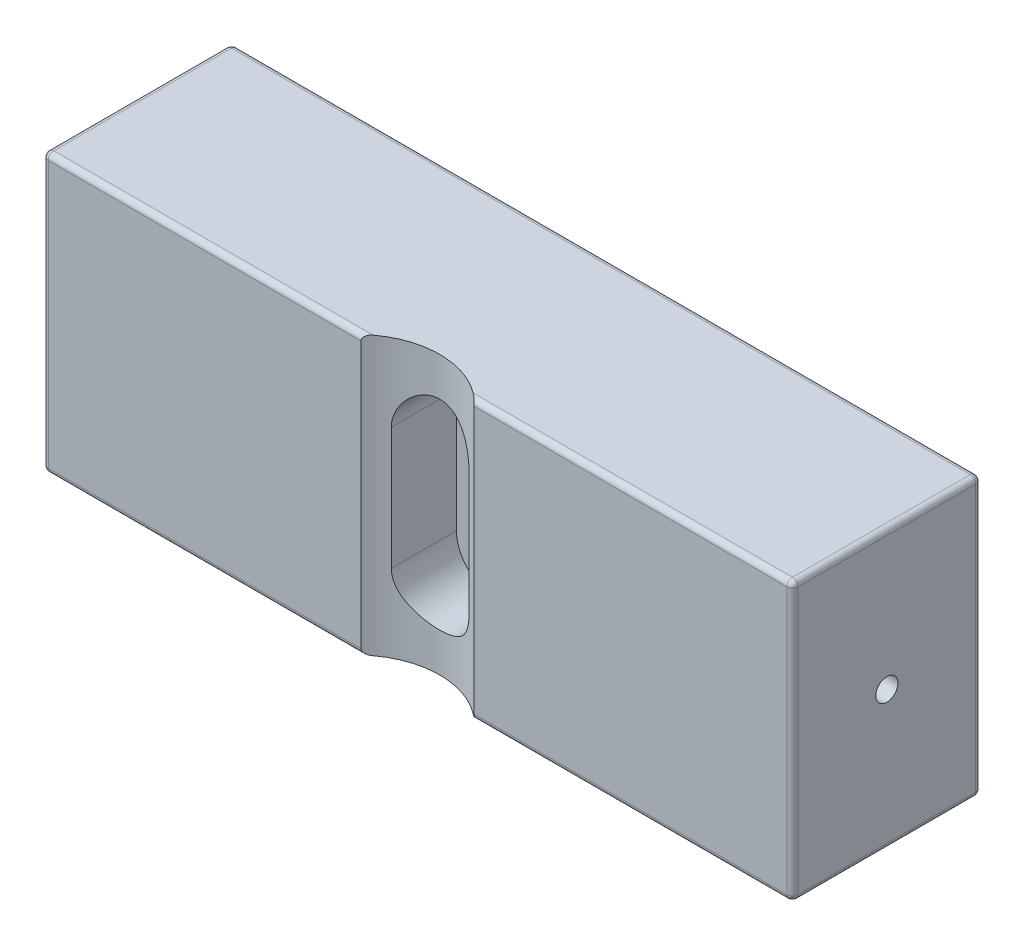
ISO-10303-21;
HEADER;
FILE_DESCRIPTION(('STEP AP214'),'2;1');
FILE_NAME('part.step','',(''),(''),'','','');
FILE_SCHEMA(('AUTOMOTIVE_DESIGN { 1 0 10303 214 1 1 1 1 }'));
ENDSEC;
DATA;
#1=APPLICATION_CONTEXT('core data for automotive mechanical design processes');
#2=APPLICATION_PROTOCOL_DEFINITION('international standard','automotive_design',2000,#1);
#3=PRODUCT_CONTEXT('',#1,'mechanical');
#4=PRODUCT('Part','Part','',(#3));
#5=PRODUCT_RELATED_PRODUCT_CATEGORY('part','',(#4));
#6=PRODUCT_DEFINITION_FORMATION('','',#4);
#7=PRODUCT_DEFINITION_CONTEXT('part definition',#1,'design');
#8=PRODUCT_DEFINITION('design','',#6,#7);
#9=PRODUCT_DEFINITION_SHAPE('','',#8);
#10=(LENGTH_UNIT() NAMED_UNIT(*) SI_UNIT(.MILLI.,.METRE.));
#11=(NAMED_UNIT(*) PLANE_ANGLE_UNIT() SI_UNIT($,.RADIAN.));
#12=(NAMED_UNIT(*) SI_UNIT($,.STERADIAN.) SOLID_ANGLE_UNIT());
#13=UNCERTAINTY_MEASURE_WITH_UNIT(LENGTH_MEASURE(1.E-05),#10,'distance_accuracy_value','');
#14=(GEOMETRIC_REPRESENTATION_CONTEXT(3) GLOBAL_UNCERTAINTY_ASSIGNED_CONTEXT((#13)) GLOBAL_UNIT_ASSIGNED_CONTEXT((#10,
#11,#12)) REPRESENTATION_CONTEXT('',''));
#15=CARTESIAN_POINT('',(0.,0.,0.));
#16=DIRECTION('',(0.,0.,1.));
#17=DIRECTION('',(1.,0.,0.));
#18=AXIS2_PLACEMENT_3D('',#15,#16,#17);
#19=CARTESIAN_POINT('',(0.,0.,34.));
#20=DIRECTION('',(0.,0.,-1.));
#21=DIRECTION('',(-1.,0.,0.));
#22=AXIS2_PLACEMENT_3D('',#19,#20,#21);
#23=PLANE('',#22);
#24=DIRECTION('',(0.,1.,0.));
#25=VECTOR('',#24,1.);
#26=CARTESIAN_POINT('',(-10.1980390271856,-67.4264068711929,34.));
#27=LINE('',#26,#25);
#28=CARTESIAN_POINT('',(-10.1980390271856,-24.,34.));
#29=VERTEX_POINT('',#28);
#30=CARTESIAN_POINT('',(-10.1980390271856,24.,34.));
#31=VERTEX_POINT('',#30);
#32=EDGE_CURVE('E221',#29,#31,#27,.T.);
#33=ORIENTED_EDGE('',*,*,#32,.T.);
#34=DIRECTION('',(-1.,0.,0.));
#35=VECTOR('',#34,1.);
#36=CARTESIAN_POINT('',(0.,24.,34.));
#37=LINE('',#36,#35);
#38=CARTESIAN_POINT('',(-66.5,24.,34.));
#39=VERTEX_POINT('',#38);
#40=EDGE_CURVE('E306',#31,#39,#37,.T.);
#41=ORIENTED_EDGE('',*,*,#40,.T.);
#42=DIRECTION('',(0.,-1.,0.));
#43=VECTOR('',#42,1.);
#44=CARTESIAN_POINT('',(-66.5,0.,34.));
#45=LINE('',#44,#43);
#46=CARTESIAN_POINT('',(-66.5,-24.,34.));
#47=VERTEX_POINT('',#46);
#48=EDGE_CURVE('E304',#39,#47,#45,.T.);
#49=ORIENTED_EDGE('',*,*,#48,.T.);
#50=DIRECTION('',(1.,0.,0.));
#51=VECTOR('',#50,1.);
#52=CARTESIAN_POINT('',(0.,-24.,34.));
#53=LINE('',#52,#51);
#54=EDGE_CURVE('E302',#47,#29,#53,.T.);
#55=ORIENTED_EDGE('',*,*,#54,.T.);
#56=EDGE_LOOP('',(#33,#41,#49,#55));
#57=FACE_BOUND('',#56,.T.);
#58=ADVANCED_FACE('F32',(#57),#23,.F.);
#59=CARTESIAN_POINT('',(67.5,-25.,34.));
#60=DIRECTION('',(-1.,0.,0.));
#61=DIRECTION('',(0.,0.,1.));
#62=AXIS2_PLACEMENT_3D('',#59,#60,#61);
#63=PLANE('',#62);
#64=DIRECTION('',(0.,1.,0.));
#65=VECTOR('',#64,1.);
#66=CARTESIAN_POINT('',(67.5,-25.,33.));
#67=LINE('',#66,#65);
#68=CARTESIAN_POINT('',(67.5,24.,33.));
#69=VERTEX_POINT('',#68);
#70=CARTESIAN_POINT('',(67.5,-24.,33.));
#71=VERTEX_POINT('',#70);
#72=EDGE_CURVE('E259',#69,#71,#67,.F.);
#73=ORIENTED_EDGE('',*,*,#72,.T.);
#74=DIRECTION('',(0.,0.,-1.));
#75=VECTOR('',#74,1.);
#76=CARTESIAN_POINT('',(67.5,-24.,34.));
#77=LINE('',#76,#75);
#78=CARTESIAN_POINT('',(67.5,-24.,1.));
#79=VERTEX_POINT('',#78);
#80=EDGE_CURVE('E264',#71,#79,#77,.T.);
#81=ORIENTED_EDGE('',*,*,#80,.T.);
#82=DIRECTION('',(0.,1.,0.));
#83=VECTOR('',#82,1.);
#84=CARTESIAN_POINT('',(67.5,25.,1.));
#85=LINE('',#84,#83);
#86=CARTESIAN_POINT('',(67.5,24.,1.));
#87=VERTEX_POINT('',#86);
#88=EDGE_CURVE('E261',#79,#87,#85,.T.);
#89=ORIENTED_EDGE('',*,*,#88,.T.);
#90=DIRECTION('',(0.,0.,-1.));
#91=VECTOR('',#90,1.);
#92=CARTESIAN_POINT('',(67.5,24.,34.));
#93=LINE('',#92,#91);
#94=EDGE_CURVE('E257',#87,#69,#93,.F.);
#95=ORIENTED_EDGE('',*,*,#94,.T.);
#96=EDGE_LOOP('',(#73,#81,#89,#95));
#97=FACE_BOUND('',#96,.T.);
#98=CARTESIAN_POINT('',(67.5,0.,17.));
#99=DIRECTION('',(-1.,0.,0.));
#100=DIRECTION('',(0.,0.,1.));
#101=AXIS2_PLACEMENT_3D('',#98,#99,#100);
#102=CIRCLE('',#101,2.00000000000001);
#103=CARTESIAN_POINT('',(67.5,0.,19.));
#104=VERTEX_POINT('',#103);
#105=EDGE_CURVE('E430',#104,#104,#102,.T.);
#106=ORIENTED_EDGE('',*,*,#105,.T.);
#107=EDGE_LOOP('',(#106));
#108=FACE_BOUND('',#107,.T.);
#109=ADVANCED_FACE('F458',(#97,#108),#63,.F.);
#110=CARTESIAN_POINT('',(-67.5,25.,34.));
#111=DIRECTION('',(0.,-1.,0.));
#112=DIRECTION('',(0.,0.,-1.));
#113=AXIS2_PLACEMENT_3D('',#110,#111,#112);
#114=PLANE('',#113);
#115=DIRECTION('',(0.,0.,-1.));
#116=VECTOR('',#115,1.);
#117=CARTESIAN_POINT('',(-66.5,25.,34.));
#118=LINE('',#117,#116);
#119=CARTESIAN_POINT('',(-66.5,25.,1.));
#120=VERTEX_POINT('',#119);
#121=CARTESIAN_POINT('',(-66.5,25.,33.));
#122=VERTEX_POINT('',#121);
#123=EDGE_CURVE('E282',#120,#122,#118,.F.);
#124=ORIENTED_EDGE('',*,*,#123,.T.);
#125=DIRECTION('',(-1.,0.,0.));
#126=VECTOR('',#125,1.);
#127=CARTESIAN_POINT('',(-67.5,25.,33.));
#128=LINE('',#127,#126);
#129=CARTESIAN_POINT('',(-9.00000000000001,25.,33.));
#130=VERTEX_POINT('',#129);
#131=EDGE_CURVE('E284',#122,#130,#128,.F.);
#132=ORIENTED_EDGE('',*,*,#131,.T.);
#133=CARTESIAN_POINT('',(0.,25.,45.));
#134=DIRECTION('',(0.,1.,0.));
#135=DIRECTION('',(0.,0.,1.));
#136=AXIS2_PLACEMENT_3D('',#133,#134,#135);
#137=CIRCLE('',#136,15.);
#138=CARTESIAN_POINT('',(9.00000000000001,25.,33.));
#139=VERTEX_POINT('',#138);
#140=EDGE_CURVE('E208',#139,#130,#137,.T.);
#141=ORIENTED_EDGE('',*,*,#140,.F.);
#142=DIRECTION('',(-1.,0.,0.));
#143=VECTOR('',#142,1.);
#144=CARTESIAN_POINT('',(-67.5,25.,33.));
#145=LINE('',#144,#143);
#146=CARTESIAN_POINT('',(66.5,25.,33.));
#147=VERTEX_POINT('',#146);
#148=EDGE_CURVE('E277',#139,#147,#145,.F.);
#149=ORIENTED_EDGE('',*,*,#148,.T.);
#150=DIRECTION('',(0.,0.,-1.));
#151=VECTOR('',#150,1.);
#152=CARTESIAN_POINT('',(66.5,25.,34.));
#153=LINE('',#152,#151);
#154=CARTESIAN_POINT('',(66.5,25.,1.));
#155=VERTEX_POINT('',#154);
#156=EDGE_CURVE('E275',#147,#155,#153,.T.);
#157=ORIENTED_EDGE('',*,*,#156,.T.);
#158=DIRECTION('',(-1.,0.,0.));
#159=VECTOR('',#158,1.);
#160=CARTESIAN_POINT('',(-67.5,25.,1.));
#161=LINE('',#160,#159);
#162=EDGE_CURVE('E279',#155,#120,#161,.T.);
#163=ORIENTED_EDGE('',*,*,#162,.T.);
#164=EDGE_LOOP('',(#124,#132,#141,#149,#157,#163));
#165=FACE_BOUND('',#164,.T.);
#166=ADVANCED_FACE('F449',(#165),#114,.F.);
#167=CARTESIAN_POINT('',(-67.5,-25.,34.));
#168=DIRECTION('',(1.,0.,0.));
#169=DIRECTION('',(0.,0.,-1.));
#170=AXIS2_PLACEMENT_3D('',#167,#168,#169);
#171=PLANE('',#170);
#172=DIRECTION('',(0.,0.,-1.));
#173=VECTOR('',#172,1.);
#174=CARTESIAN_POINT('',(-67.5,-24.,34.));
#175=LINE('',#174,#173);
#176=CARTESIAN_POINT('',(-67.5,-24.,1.));
#177=VERTEX_POINT('',#176);
#178=CARTESIAN_POINT('',(-67.5,-24.,33.));
#179=VERTEX_POINT('',#178);
#180=EDGE_CURVE('E42',#177,#179,#175,.F.);
#181=ORIENTED_EDGE('',*,*,#180,.T.);
#182=DIRECTION('',(0.,-1.,0.));
#183=VECTOR('',#182,1.);
#184=CARTESIAN_POINT('',(-67.5,-25.,33.));
#185=LINE('',#184,#183);
#186=CARTESIAN_POINT('',(-67.5,24.,33.));
#187=VERTEX_POINT('',#186);
#188=EDGE_CURVE('E11',#179,#187,#185,.F.);
#189=ORIENTED_EDGE('',*,*,#188,.T.);
#190=DIRECTION('',(0.,0.,-1.));
#191=VECTOR('',#190,1.);
#192=CARTESIAN_POINT('',(-67.5,24.,34.));
#193=LINE('',#192,#191);
#194=CARTESIAN_POINT('',(-67.5,24.,1.));
#195=VERTEX_POINT('',#194);
#196=EDGE_CURVE('E56',#187,#195,#193,.T.);
#197=ORIENTED_EDGE('',*,*,#196,.T.);
#198=DIRECTION('',(0.,-1.,0.));
#199=VECTOR('',#198,1.);
#200=CARTESIAN_POINT('',(-67.5,-25.,1.));
#201=LINE('',#200,#199);
#202=EDGE_CURVE('E360',#195,#177,#201,.T.);
#203=ORIENTED_EDGE('',*,*,#202,.T.);
#204=EDGE_LOOP('',(#181,#189,#197,#203));
#205=FACE_BOUND('',#204,.T.);
#206=CARTESIAN_POINT('',(-67.5,0.,17.));
#207=DIRECTION('',(-1.,0.,0.));
#208=DIRECTION('',(0.,0.,1.));
#209=AXIS2_PLACEMENT_3D('',#206,#207,#208);
#210=CIRCLE('',#209,2.00000000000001);
#211=CARTESIAN_POINT('',(-67.5,0.,19.));
#212=VERTEX_POINT('',#211);
#213=EDGE_CURVE('E200',#212,#212,#210,.T.);
#214=ORIENTED_EDGE('',*,*,#213,.F.);
#215=EDGE_LOOP('',(#214));
#216=FACE_BOUND('',#215,.T.);
#217=ADVANCED_FACE('F446',(#205,#216),#171,.F.);
#218=CARTESIAN_POINT('',(-67.5,-25.,34.));
#219=DIRECTION('',(0.,1.,0.));
#220=DIRECTION('',(0.,0.,1.));
#221=AXIS2_PLACEMENT_3D('',#218,#219,#220);
#222=PLANE('',#221);
#223=DIRECTION('',(0.,0.,-1.));
#224=VECTOR('',#223,1.);
#225=CARTESIAN_POINT('',(66.5,-25.,34.));
#226=LINE('',#225,#224);
#227=CARTESIAN_POINT('',(66.5,-25.,1.));
#228=VERTEX_POINT('',#227);
#229=CARTESIAN_POINT('',(66.5,-25.,33.));
#230=VERTEX_POINT('',#229);
#231=EDGE_CURVE('E292',#228,#230,#226,.F.);
#232=ORIENTED_EDGE('',*,*,#231,.T.);
#233=DIRECTION('',(1.,0.,0.));
#234=VECTOR('',#233,1.);
#235=CARTESIAN_POINT('',(-67.5,-25.,33.));
#236=LINE('',#235,#234);
#237=CARTESIAN_POINT('',(9.00000000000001,-25.,33.));
#238=VERTEX_POINT('',#237);
#239=EDGE_CURVE('E294',#230,#238,#236,.F.);
#240=ORIENTED_EDGE('',*,*,#239,.T.);
#241=CARTESIAN_POINT('',(0.,-25.,45.));
#242=DIRECTION('',(0.,1.,0.));
#243=DIRECTION('',(0.,0.,1.));
#244=AXIS2_PLACEMENT_3D('',#241,#242,#243);
#245=CIRCLE('',#244,15.);
#246=CARTESIAN_POINT('',(-9.00000000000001,-25.,33.));
#247=VERTEX_POINT('',#246);
#248=EDGE_CURVE('E215',#247,#238,#245,.F.);
#249=ORIENTED_EDGE('',*,*,#248,.F.);
#250=DIRECTION('',(1.,0.,0.));
#251=VECTOR('',#250,1.);
#252=CARTESIAN_POINT('',(-67.5,-25.,33.));
#253=LINE('',#252,#251);
#254=CARTESIAN_POINT('',(-66.5,-25.,33.));
#255=VERTEX_POINT('',#254);
#256=EDGE_CURVE('E288',#247,#255,#253,.F.);
#257=ORIENTED_EDGE('',*,*,#256,.T.);
#258=DIRECTION('',(0.,0.,-1.));
#259=VECTOR('',#258,1.);
#260=CARTESIAN_POINT('',(-66.5,-25.,34.));
#261=LINE('',#260,#259);
#262=CARTESIAN_POINT('',(-66.5,-25.,1.));
#263=VERTEX_POINT('',#262);
#264=EDGE_CURVE('E286',#255,#263,#261,.T.);
#265=ORIENTED_EDGE('',*,*,#264,.T.);
#266=DIRECTION('',(1.,0.,0.));
#267=VECTOR('',#266,1.);
#268=CARTESIAN_POINT('',(67.5,-25.,1.));
#269=LINE('',#268,#267);
#270=EDGE_CURVE('E290',#263,#228,#269,.T.);
#271=ORIENTED_EDGE('',*,*,#270,.T.);
#272=EDGE_LOOP('',(#232,#240,#249,#257,#265,#271));
#273=FACE_BOUND('',#272,.T.);
#274=ADVANCED_FACE('F448',(#273),#222,.F.);
#275=DIRECTION('',(0.,1.,0.));
#276=VECTOR('',#275,1.);
#277=CARTESIAN_POINT('',(66.5,0.,34.));
#278=LINE('',#277,#276);
#279=CARTESIAN_POINT('',(66.5,-24.,34.));
#280=VERTEX_POINT('',#279);
#281=CARTESIAN_POINT('',(66.5,24.,34.));
#282=VERTEX_POINT('',#281);
#283=EDGE_CURVE('E298',#280,#282,#278,.T.);
#284=ORIENTED_EDGE('',*,*,#283,.T.);
#285=DIRECTION('',(-1.,0.,0.));
#286=VECTOR('',#285,1.);
#287=CARTESIAN_POINT('',(0.,24.,34.));
#288=LINE('',#287,#286);
#289=CARTESIAN_POINT('',(10.1980390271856,24.,34.));
#290=VERTEX_POINT('',#289);
#291=EDGE_CURVE('E300',#282,#290,#288,.T.);
#292=ORIENTED_EDGE('',*,*,#291,.T.);
#293=DIRECTION('',(0.,1.,0.));
#294=VECTOR('',#293,1.);
#295=CARTESIAN_POINT('',(10.1980390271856,-67.4264068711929,34.));
#296=LINE('',#295,#294);
#297=CARTESIAN_POINT('',(10.1980390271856,-24.,34.));
#298=VERTEX_POINT('',#297);
#299=EDGE_CURVE('E218',#290,#298,#296,.F.);
#300=ORIENTED_EDGE('',*,*,#299,.T.);
#301=DIRECTION('',(1.,0.,0.));
#302=VECTOR('',#301,1.);
#303=CARTESIAN_POINT('',(0.,-24.,34.));
#304=LINE('',#303,#302);
#305=EDGE_CURVE('E296',#298,#280,#304,.T.);
#306=ORIENTED_EDGE('',*,*,#305,.T.);
#307=EDGE_LOOP('',(#284,#292,#300,#306));
#308=FACE_BOUND('',#307,.T.);
#309=ADVANCED_FACE('F455',(#308),#23,.F.);
#310=CARTESIAN_POINT('',(0.,0.,0.));
#311=DIRECTION('',(0.,0.,-1.));
#312=DIRECTION('',(-1.,0.,0.));
#313=AXIS2_PLACEMENT_3D('',#310,#311,#312);
#314=PLANE('',#313);
#315=DIRECTION('',(-1.,0.,0.));
#316=VECTOR('',#315,1.);
#317=CARTESIAN_POINT('',(67.5,24.,0.));
#318=LINE('',#317,#316);
#319=CARTESIAN_POINT('',(-66.5,24.,0.));
#320=VERTEX_POINT('',#319);
#321=CARTESIAN_POINT('',(66.5,24.,0.));
#322=VERTEX_POINT('',#321);
#323=EDGE_CURVE('E270',#320,#322,#318,.F.);
#324=ORIENTED_EDGE('',*,*,#323,.T.);
#325=DIRECTION('',(0.,1.,0.));
#326=VECTOR('',#325,1.);
#327=CARTESIAN_POINT('',(66.5,-25.,0.));
#328=LINE('',#327,#326);
#329=CARTESIAN_POINT('',(66.5,-24.,0.));
#330=VERTEX_POINT('',#329);
#331=EDGE_CURVE('E272',#322,#330,#328,.F.);
#332=ORIENTED_EDGE('',*,*,#331,.T.);
#333=DIRECTION('',(1.,0.,0.));
#334=VECTOR('',#333,1.);
#335=CARTESIAN_POINT('',(-67.5,-24.,0.));
#336=LINE('',#335,#334);
#337=CARTESIAN_POINT('',(-66.5,-24.,0.));
#338=VERTEX_POINT('',#337);
#339=EDGE_CURVE('E268',#330,#338,#336,.F.);
#340=ORIENTED_EDGE('',*,*,#339,.T.);
#341=DIRECTION('',(0.,-1.,0.));
#342=VECTOR('',#341,1.);
#343=CARTESIAN_POINT('',(-66.5,25.,0.));
#344=LINE('',#343,#342);
#345=EDGE_CURVE('E266',#338,#320,#344,.F.);
#346=ORIENTED_EDGE('',*,*,#345,.T.);
#347=EDGE_LOOP('',(#324,#332,#340,#346));
#348=FACE_BOUND('',#347,.T.);
#349=ADVANCED_FACE('F470',(#348),#314,.T.);
#350=CARTESIAN_POINT('',(0.,-67.4264068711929,45.));
#351=DIRECTION('',(0.,1.,0.));
#352=DIRECTION('',(0.,0.,1.));
#353=AXIS2_PLACEMENT_3D('',#350,#351,#352);
#354=CYLINDRICAL_SURFACE('',#353,15.);
#355=DIRECTION('',(0.,1.,0.));
#356=VECTOR('',#355,1.);
#357=CARTESIAN_POINT('',(7.00000000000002,-67.4264068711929,31.7335008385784));
#358=LINE('',#357,#356);
#359=CARTESIAN_POINT('',(7.,11.,31.7335008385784));
#360=VERTEX_POINT('',#359);
#361=CARTESIAN_POINT('',(7.00000000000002,-11.,31.7335008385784));
#362=VERTEX_POINT('',#361);
#363=EDGE_CURVE('E224',#360,#362,#358,.F.);
#364=ORIENTED_EDGE('',*,*,#363,.T.);
#365=CARTESIAN_POINT('',(7.,-11.,31.7335008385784));
#366=CARTESIAN_POINT('',(7.00003274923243,-11.1851244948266,31.7335501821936));
#367=CARTESIAN_POINT('',(6.99265774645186,-11.3702267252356,31.7296275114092));
#368=CARTESIAN_POINT('',(6.96334178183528,-11.7388617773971,31.7142041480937));
#369=CARTESIAN_POINT('',(6.94140847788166,-11.9223953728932,31.7027074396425));
#370=CARTESIAN_POINT('',(6.88337286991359,-12.2856402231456,31.6725780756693));
#371=CARTESIAN_POINT('',(6.84734316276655,-12.4653661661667,31.6539819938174));
#372=CARTESIAN_POINT('',(6.76154095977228,-12.8207064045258,31.6103064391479));
#373=CARTESIAN_POINT('',(6.71176716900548,-12.9963203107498,31.5852263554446));
#374=CARTESIAN_POINT('',(6.59910143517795,-13.3419716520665,31.5294472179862));
#375=CARTESIAN_POINT('',(6.53623584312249,-13.5120195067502,31.4987594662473));
#376=CARTESIAN_POINT('',(6.39789853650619,-13.8459808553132,31.432657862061));
#377=CARTESIAN_POINT('',(6.32242204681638,-14.0098919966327,31.3972422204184));
#378=CARTESIAN_POINT('',(6.07778751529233,-14.4914233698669,31.2853119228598));
#379=CARTESIAN_POINT('',(5.89046347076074,-14.7987228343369,31.2031341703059));
#380=CARTESIAN_POINT('',(5.45752973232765,-15.4002848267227,31.0259583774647));
#381=CARTESIAN_POINT('',(5.20873505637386,-15.6920886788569,30.9304646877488));
#382=CARTESIAN_POINT('',(4.66630119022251,-16.2318046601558,30.7413927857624));
#383=CARTESIAN_POINT('',(4.3726510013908,-16.4797059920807,30.6478150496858));
#384=CARTESIAN_POINT('',(3.89437528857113,-16.8202410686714,30.5133322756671));
#385=CARTESIAN_POINT('',(3.72352355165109,-16.9310201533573,30.4683737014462));
#386=CARTESIAN_POINT('',(3.37202239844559,-17.1376677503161,30.3828145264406));
#387=CARTESIAN_POINT('',(3.19137712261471,-17.2335424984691,30.3422121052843));
#388=CARTESIAN_POINT('',(2.82147212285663,-17.4094652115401,30.2665367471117));
#389=CARTESIAN_POINT('',(2.63221405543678,-17.4895162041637,30.231462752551));
#390=CARTESIAN_POINT('',(2.24641271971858,-17.6329454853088,30.1678784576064));
#391=CARTESIAN_POINT('',(2.04987011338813,-17.6963252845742,30.1393675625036));
#392=CARTESIAN_POINT('',(1.6637103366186,-17.8021742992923,30.0913616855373));
#393=CARTESIAN_POINT('',(1.47444294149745,-17.8457136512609,30.0714100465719));
#394=CARTESIAN_POINT('',(1.09234411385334,-17.9169751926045,30.0385982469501));
#395=CARTESIAN_POINT('',(0.899512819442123,-17.9446979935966,30.0257378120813));
#396=CARTESIAN_POINT('',(0.511939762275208,-17.9839703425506,30.0074838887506));
#397=CARTESIAN_POINT('',(0.317198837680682,-17.9955266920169,30.0020872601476));
#398=CARTESIAN_POINT('',(-0.0726257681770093,-18.0023368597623,29.9989096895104));
#399=CARTESIAN_POINT('',(-0.267709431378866,-17.9975915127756,30.0011283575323));
#400=CARTESIAN_POINT('',(-0.641717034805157,-17.9728473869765,30.0126554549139));
#401=CARTESIAN_POINT('',(-0.820738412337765,-17.9540398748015,30.0214101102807));
#402=CARTESIAN_POINT('',(-1.17645951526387,-17.9027707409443,30.0451437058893));
#403=CARTESIAN_POINT('',(-1.35315842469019,-17.8703044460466,30.0601247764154));
#404=CARTESIAN_POINT('',(-1.70290661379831,-17.7920696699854,30.0959400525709));
#405=CARTESIAN_POINT('',(-1.87595719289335,-17.7463060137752,30.1167721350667));
#406=CARTESIAN_POINT('',(-2.21744279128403,-17.6419006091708,30.1638053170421));
#407=CARTESIAN_POINT('',(-2.38587601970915,-17.5832539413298,30.1900084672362));
#408=CARTESIAN_POINT('',(-2.7194870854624,-17.4526685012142,30.2475952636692));
#409=CARTESIAN_POINT('',(-2.88458239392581,-17.380549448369,30.2790484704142));
#410=CARTESIAN_POINT('',(-3.20807160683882,-17.22419439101,30.3461397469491));
#411=CARTESIAN_POINT('',(-3.36646305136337,-17.1399539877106,30.3817793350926));
#412=CARTESIAN_POINT('',(-3.83032730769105,-16.8699591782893,30.4938113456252));
#413=CARTESIAN_POINT('',(-4.12468757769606,-16.6668532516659,30.5753525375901));
#414=CARTESIAN_POINT('',(-4.70140559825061,-16.2005767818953,30.7523486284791));
#415=CARTESIAN_POINT('',(-4.9806178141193,-15.933768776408,30.8483970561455));
#416=CARTESIAN_POINT('',(-5.49207336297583,-15.357234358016,31.0389236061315));
#417=CARTESIAN_POINT('',(-5.72428311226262,-15.0474775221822,31.1334005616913));
#418=CARTESIAN_POINT('',(-6.03795030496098,-14.5474792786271,31.2683922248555));
#419=CARTESIAN_POINT('',(-6.13867739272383,-14.3702200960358,31.3132506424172));
#420=CARTESIAN_POINT('',(-6.32466275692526,-14.0067033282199,31.3981958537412));
#421=CARTESIAN_POINT('',(-6.40992781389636,-13.8204497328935,31.4382847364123));
#422=CARTESIAN_POINT('',(-6.56402317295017,-13.4404053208,31.5121940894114));
#423=CARTESIAN_POINT('',(-6.63287915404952,-13.2466268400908,31.5460243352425));
#424=CARTESIAN_POINT('',(-6.7534883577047,-12.85278346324,31.6061607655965));
#425=CARTESIAN_POINT('',(-6.80524910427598,-12.6527213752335,31.6324702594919));
#426=CARTESIAN_POINT('',(-6.89835333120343,-12.2130277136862,31.6802412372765));
#427=CARTESIAN_POINT('',(-6.93638471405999,-11.972497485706,31.7000959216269));
#428=CARTESIAN_POINT('',(-6.97450458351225,-11.6092331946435,31.720072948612));
#429=CARTESIAN_POINT('',(-6.98405670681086,-11.4876733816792,31.7250978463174));
#430=CARTESIAN_POINT('',(-6.99680619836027,-11.2440864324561,31.7318150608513));
#431=CARTESIAN_POINT('',(-7.0000013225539,-11.1220591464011,31.7335062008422));
#432=CARTESIAN_POINT('',(-7.,-11.,31.7335008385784));
#433=B_SPLINE_CURVE_WITH_KNOTS('',3,(#365,#366,#367,#368,#369,#370,#371,#372,#373,#374,#375,
#376,#377,#378,#379,#380,#381,#382,#383,#384,#385,#386,#387,#388,#389,#390,#391,#392,#393,#394,
#395,#396,#397,#398,#399,#400,#401,#402,#403,#404,#405,#406,#407,#408,#409,#410,#411,#412,#413,
#414,#415,#416,#417,#418,#419,#420,#421,#422,#423,#424,#425,#426,#427,#428,#429,#430,#431,#432),
.UNSPECIFIED.,.F.,.F.,(4,2,2,2,2,2,2,2,2,2,2,2,2,2,2,2,2,2,2,2,2,2,2,2,2,2,2,2,2,2,2,2,2,4),(0.,
0.555149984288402,1.11000818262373,1.66204568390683,2.21413521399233,2.76512406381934,
3.31632202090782,4.41909352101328,5.59984914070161,6.78089474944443,7.40580354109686,
8.03045016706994,8.65497715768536,9.27944753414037,9.86436700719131,10.4492638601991,
11.0339145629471,11.6185353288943,12.158556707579,12.6987629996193,13.2387735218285,
13.7789906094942,14.3270350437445,14.8752788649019,15.971127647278,17.1600982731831,
18.3499154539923,18.9755024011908,19.6008143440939,20.2251411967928,20.8491929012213,
21.5803389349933,21.9462710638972,22.3123323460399),.UNSPECIFIED.);
#434=CARTESIAN_POINT('',(-7.,-11.,31.7335008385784));
#435=VERTEX_POINT('',#434);
#436=EDGE_CURVE('E180',#362,#435,#433,.T.);
#437=ORIENTED_EDGE('',*,*,#436,.T.);
#438=DIRECTION('',(0.,1.,0.));
#439=VECTOR('',#438,1.);
#440=CARTESIAN_POINT('',(-6.99999999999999,-67.4264068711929,31.7335008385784));
#441=LINE('',#440,#439);
#442=CARTESIAN_POINT('',(-7.00000000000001,11.,31.7335008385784));
#443=VERTEX_POINT('',#442);
#444=EDGE_CURVE('E235',#435,#443,#441,.T.);
#445=ORIENTED_EDGE('',*,*,#444,.T.);
#446=CARTESIAN_POINT('',(-7.00000000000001,11.,31.7335008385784));
#447=CARTESIAN_POINT('',(-7.00003274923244,11.1851244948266,31.7335501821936));
#448=CARTESIAN_POINT('',(-6.99265774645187,11.3702267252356,31.7296275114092));
#449=CARTESIAN_POINT('',(-6.96334178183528,11.7388617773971,31.7142041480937));
#450=CARTESIAN_POINT('',(-6.94140847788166,11.9223953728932,31.7027074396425));
#451=CARTESIAN_POINT('',(-6.8833728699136,12.2856402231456,31.6725780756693));
#452=CARTESIAN_POINT('',(-6.84734316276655,12.4653661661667,31.6539819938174));
#453=CARTESIAN_POINT('',(-6.76154095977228,12.8207064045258,31.6103064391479));
#454=CARTESIAN_POINT('',(-6.71176716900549,12.9963203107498,31.5852263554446));
#455=CARTESIAN_POINT('',(-6.59910143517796,13.3419716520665,31.5294472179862));
#456=CARTESIAN_POINT('',(-6.5362358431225,13.5120195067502,31.4987594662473));
#457=CARTESIAN_POINT('',(-6.39789853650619,13.8459808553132,31.432657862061));
#458=CARTESIAN_POINT('',(-6.32242204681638,14.0098919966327,31.3972422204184));
#459=CARTESIAN_POINT('',(-6.07778751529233,14.4914233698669,31.2853119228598));
#460=CARTESIAN_POINT('',(-5.89046347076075,14.7987228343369,31.2031341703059));
#461=CARTESIAN_POINT('',(-5.45752973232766,15.4002848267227,31.0259583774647));
#462=CARTESIAN_POINT('',(-5.20873505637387,15.6920886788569,30.9304646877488));
#463=CARTESIAN_POINT('',(-4.66630119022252,16.2318046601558,30.7413927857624));
#464=CARTESIAN_POINT('',(-4.37265100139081,16.4797059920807,30.6478150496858));
#465=CARTESIAN_POINT('',(-3.89437528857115,16.8202410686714,30.5133322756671));
#466=CARTESIAN_POINT('',(-3.7235235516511,16.9310201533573,30.4683737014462));
#467=CARTESIAN_POINT('',(-3.37202239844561,17.1376677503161,30.3828145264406));
#468=CARTESIAN_POINT('',(-3.19137712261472,17.2335424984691,30.3422121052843));
#469=CARTESIAN_POINT('',(-2.82147212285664,17.4094652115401,30.2665367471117));
#470=CARTESIAN_POINT('',(-2.6322140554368,17.4895162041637,30.231462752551));
#471=CARTESIAN_POINT('',(-2.2464127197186,17.6329454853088,30.1678784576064));
#472=CARTESIAN_POINT('',(-2.04987011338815,17.6963252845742,30.1393675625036));
#473=CARTESIAN_POINT('',(-1.66371033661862,17.8021742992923,30.0913616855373));
#474=CARTESIAN_POINT('',(-1.47444294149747,17.8457136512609,30.0714100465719));
#475=CARTESIAN_POINT('',(-1.09234411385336,17.9169751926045,30.0385982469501));
#476=CARTESIAN_POINT('',(-0.89951281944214,17.9446979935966,30.0257378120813));
#477=CARTESIAN_POINT('',(-0.511939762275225,17.9839703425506,30.0074838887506));
#478=CARTESIAN_POINT('',(-0.317198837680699,17.9955266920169,30.0020872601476));
#479=CARTESIAN_POINT('',(0.0726257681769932,18.0023368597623,29.9989096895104));
#480=CARTESIAN_POINT('',(0.267709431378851,17.9975915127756,30.0011283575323));
#481=CARTESIAN_POINT('',(0.641717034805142,17.9728473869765,30.0126554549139));
#482=CARTESIAN_POINT('',(0.82073841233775,17.9540398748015,30.0214101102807));
#483=CARTESIAN_POINT('',(1.17645951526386,17.9027707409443,30.0451437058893));
#484=CARTESIAN_POINT('',(1.35315842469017,17.8703044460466,30.0601247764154));
#485=CARTESIAN_POINT('',(1.7029066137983,17.7920696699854,30.0959400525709));
#486=CARTESIAN_POINT('',(1.87595719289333,17.7463060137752,30.1167721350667));
#487=CARTESIAN_POINT('',(2.21744279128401,17.6419006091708,30.1638053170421));
#488=CARTESIAN_POINT('',(2.38587601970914,17.5832539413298,30.1900084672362));
#489=CARTESIAN_POINT('',(2.71948708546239,17.4526685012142,30.2475952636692));
#490=CARTESIAN_POINT('',(2.8845823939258,17.380549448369,30.2790484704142));
#491=CARTESIAN_POINT('',(3.20807160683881,17.22419439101,30.3461397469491));
#492=CARTESIAN_POINT('',(3.36646305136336,17.1399539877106,30.3817793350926));
#493=CARTESIAN_POINT('',(3.83032730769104,16.8699591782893,30.4938113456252));
#494=CARTESIAN_POINT('',(4.12468757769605,16.6668532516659,30.5753525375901));
#495=CARTESIAN_POINT('',(4.7014055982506,16.2005767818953,30.7523486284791));
#496=CARTESIAN_POINT('',(4.98061781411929,15.933768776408,30.8483970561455));
#497=CARTESIAN_POINT('',(5.49207336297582,15.357234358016,31.0389236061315));
#498=CARTESIAN_POINT('',(5.7242831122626,15.0474775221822,31.1334005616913));
#499=CARTESIAN_POINT('',(6.03795030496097,14.5474792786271,31.2683922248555));
#500=CARTESIAN_POINT('',(6.13867739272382,14.3702200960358,31.3132506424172));
#501=CARTESIAN_POINT('',(6.32466275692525,14.0067033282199,31.3981958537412));
#502=CARTESIAN_POINT('',(6.40992781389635,13.8204497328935,31.4382847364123));
#503=CARTESIAN_POINT('',(6.56402317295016,13.4404053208,31.5121940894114));
#504=CARTESIAN_POINT('',(6.63287915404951,13.2466268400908,31.5460243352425));
#505=CARTESIAN_POINT('',(6.7534883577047,12.85278346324,31.6061607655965));
#506=CARTESIAN_POINT('',(6.80524910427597,12.6527213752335,31.6324702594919));
#507=CARTESIAN_POINT('',(6.89835333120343,12.2130277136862,31.6802412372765));
#508=CARTESIAN_POINT('',(6.93638471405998,11.972497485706,31.7000959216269));
#509=CARTESIAN_POINT('',(6.97450458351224,11.6092331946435,31.720072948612));
#510=CARTESIAN_POINT('',(6.98405670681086,11.4876733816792,31.7250978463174));
#511=CARTESIAN_POINT('',(6.99680619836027,11.2440864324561,31.7318150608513));
#512=CARTESIAN_POINT('',(7.00000132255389,11.1220591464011,31.7335062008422));
#513=CARTESIAN_POINT('',(7.,11.,31.7335008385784));
#514=B_SPLINE_CURVE_WITH_KNOTS('',3,(#446,#447,#448,#449,#450,#451,#452,#453,#454,#455,#456,
#457,#458,#459,#460,#461,#462,#463,#464,#465,#466,#467,#468,#469,#470,#471,#472,#473,#474,#475,
#476,#477,#478,#479,#480,#481,#482,#483,#484,#485,#486,#487,#488,#489,#490,#491,#492,#493,#494,
#495,#496,#497,#498,#499,#500,#501,#502,#503,#504,#505,#506,#507,#508,#509,#510,#511,#512,#513),
.UNSPECIFIED.,.F.,.F.,(4,2,2,2,2,2,2,2,2,2,2,2,2,2,2,2,2,2,2,2,2,2,2,2,2,2,2,2,2,2,2,2,2,4),(0.,
0.555149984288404,1.11000818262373,1.66204568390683,2.21413521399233,2.76512406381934,
3.31632202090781,4.41909352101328,5.59984914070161,6.78089474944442,7.40580354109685,
8.03045016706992,8.65497715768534,9.27944753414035,9.8643670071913,10.4492638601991,
11.0339145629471,11.6185353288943,12.158556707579,12.6987629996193,13.2387735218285,
13.7789906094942,14.3270350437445,14.8752788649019,15.971127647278,17.1600982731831,
18.3499154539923,18.9755024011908,19.6008143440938,20.2251411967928,20.8491929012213,
21.5803389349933,21.9462710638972,22.3123323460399),.UNSPECIFIED.);
#515=EDGE_CURVE('E226',#443,#360,#514,.T.);
#516=ORIENTED_EDGE('',*,*,#515,.T.);
#517=EDGE_LOOP('',(#364,#437,#445,#516));
#518=FACE_BOUND('',#517,.T.);
#519=ORIENTED_EDGE('',*,*,#140,.T.);
#520=CARTESIAN_POINT('',(-9.00000000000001,25.,33.));
#521=CARTESIAN_POINT('',(-9.05562458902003,24.9999753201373,33.0417120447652));
#522=CARTESIAN_POINT('',(-9.1109859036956,24.9973868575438,33.0838435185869));
#523=CARTESIAN_POINT('',(-9.22098644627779,24.9865967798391,33.1687610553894));
#524=CARTESIAN_POINT('',(-9.27562203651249,24.9783734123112,33.2115490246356));
#525=CARTESIAN_POINT('',(-9.38429669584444,24.9556621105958,33.2978691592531));
#526=CARTESIAN_POINT('',(-9.43831654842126,24.9410876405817,33.341403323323));
#527=CARTESIAN_POINT('',(-9.54426805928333,24.905002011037,33.4279814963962));
#528=CARTESIAN_POINT('',(-9.59620332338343,24.8835034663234,33.4710262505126));
#529=CARTESIAN_POINT('',(-9.69611257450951,24.8332984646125,33.5549329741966));
#530=CARTESIAN_POINT('',(-9.74414950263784,24.8047655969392,33.5958222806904));
#531=CARTESIAN_POINT('',(-9.83625125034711,24.7394445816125,33.6751674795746));
#532=CARTESIAN_POINT('',(-9.88032940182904,24.7026857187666,33.7136313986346));
#533=CARTESIAN_POINT('',(-9.95536580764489,24.6276313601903,33.7798074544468));
#534=CARTESIAN_POINT('',(-9.9872453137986,24.5908655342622,33.8081951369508));
#535=CARTESIAN_POINT('',(-10.0460413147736,24.5109423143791,33.8609422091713));
#536=CARTESIAN_POINT('',(-10.0729627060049,24.4677913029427,33.885305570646));
#537=CARTESIAN_POINT('',(-10.1147059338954,24.3860776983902,33.9232977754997));
#538=CARTESIAN_POINT('',(-10.1308861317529,24.3487614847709,33.9381061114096));
#539=CARTESIAN_POINT('',(-10.1584602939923,24.2710672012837,33.9634228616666));
#540=CARTESIAN_POINT('',(-10.1698649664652,24.2306962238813,33.9739408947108));
#541=CARTESIAN_POINT('',(-10.1849111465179,24.1585795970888,33.9878401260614));
#542=CARTESIAN_POINT('',(-10.1897984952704,24.1273095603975,33.9923644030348));
#543=CARTESIAN_POINT('',(-10.1963789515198,24.0640397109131,33.9984609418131));
#544=CARTESIAN_POINT('',(-10.1980603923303,24.0320376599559,34.0000224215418));
#545=CARTESIAN_POINT('',(-10.1980390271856,24.,34.));
#546=B_SPLINE_CURVE_WITH_KNOTS('',3,(#520,#521,#522,#523,#524,#525,#526,#527,#528,#529,#530,
#531,#532,#533,#534,#535,#536,#537,#538,#539,#540,#541,#542,#543,#544,#545),.UNSPECIFIED.,.F.,
.F.,(4,2,2,2,2,2,2,2,2,2,2,2,4),(0.,0.208594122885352,0.417998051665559,0.6303490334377,
0.842315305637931,1.04949865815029,1.25595584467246,1.42439173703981,1.59266038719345,
1.72201818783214,1.85108435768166,1.94670719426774,2.04267735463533),.UNSPECIFIED.);
#547=EDGE_CURVE('E354',#130,#31,#546,.T.);
#548=ORIENTED_EDGE('',*,*,#547,.T.);
#549=ORIENTED_EDGE('',*,*,#32,.F.);
#550=CARTESIAN_POINT('',(-10.1980390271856,-24.,34.));
#551=CARTESIAN_POINT('',(-10.1980418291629,-24.0217460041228,34.0000030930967));
#552=CARTESIAN_POINT('',(-10.1972732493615,-24.043478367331,33.999290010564));
#553=CARTESIAN_POINT('',(-10.1942272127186,-24.0867287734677,33.9964670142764));
#554=CARTESIAN_POINT('',(-10.1919509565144,-24.1082469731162,33.994358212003));
#555=CARTESIAN_POINT('',(-10.1829674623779,-24.1718422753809,33.9860432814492));
#556=CARTESIAN_POINT('',(-10.1741040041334,-24.2133840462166,33.9778470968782));
#557=CARTESIAN_POINT('',(-10.1512833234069,-24.2936052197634,33.956826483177));
#558=CARTESIAN_POINT('',(-10.1373405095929,-24.3322923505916,33.9440151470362));
#559=CARTESIAN_POINT('',(-10.1051528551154,-24.4063516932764,33.9145878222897));
#560=CARTESIAN_POINT('',(-10.0868981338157,-24.4417160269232,33.8979630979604));
#561=CARTESIAN_POINT('',(-10.0385413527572,-24.5227643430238,33.8541874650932));
#562=CARTESIAN_POINT('',(-10.006676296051,-24.5665849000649,33.825541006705));
#563=CARTESIAN_POINT('',(-9.93788326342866,-24.6468223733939,33.7643152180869));
#564=CARTESIAN_POINT('',(-9.90094709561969,-24.6832270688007,33.7317295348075));
#565=CARTESIAN_POINT('',(-9.80527307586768,-24.7645835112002,33.6482474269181));
#566=CARTESIAN_POINT('',(-9.74442260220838,-24.8055604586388,33.5959192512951));
#567=CARTESIAN_POINT('',(-9.61762561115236,-24.8747464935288,33.4887782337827));
#568=CARTESIAN_POINT('',(-9.55165967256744,-24.9029038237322,33.4339562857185));
#569=CARTESIAN_POINT('',(-9.44508744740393,-24.9385021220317,33.3469798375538));
#570=CARTESIAN_POINT('',(-9.4055131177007,-24.9496724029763,33.3150118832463));
#571=CARTESIAN_POINT('',(-9.32551974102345,-24.9685425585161,33.2510723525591));
#572=CARTESIAN_POINT('',(-9.28510039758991,-24.9762411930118,33.2191007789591));
#573=CARTESIAN_POINT('',(-9.20412837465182,-24.9883195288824,33.1557342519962));
#574=CARTESIAN_POINT('',(-9.16358316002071,-24.9927380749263,33.1243369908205));
#575=CARTESIAN_POINT('',(-9.08207584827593,-24.9985732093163,33.0618870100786));
#576=CARTESIAN_POINT('',(-9.04111420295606,-24.9999927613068,33.0308339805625));
#577=CARTESIAN_POINT('',(-9.00000000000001,-25.,33.));
#578=B_SPLINE_CURVE_WITH_KNOTS('',3,(#550,#551,#552,#553,#554,#555,#556,#557,#558,#559,#560,
#561,#562,#563,#564,#565,#566,#567,#568,#569,#570,#571,#572,#573,#574,#575,#576,#577),
.UNSPECIFIED.,.F.,.F.,(4,2,2,2,2,2,2,2,2,2,2,2,2,4),(0.,0.06518695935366,0.130322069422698,
0.259340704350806,0.3879961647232,0.516949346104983,0.699791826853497,0.882933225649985,
1.15179425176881,1.42173134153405,1.57787751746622,1.73407942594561,1.88840062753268,
2.04256925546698),.UNSPECIFIED.);
#579=EDGE_CURVE('E308',#29,#247,#578,.T.);
#580=ORIENTED_EDGE('',*,*,#579,.T.);
#581=ORIENTED_EDGE('',*,*,#248,.T.);
#582=CARTESIAN_POINT('',(9.00000000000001,-25.,33.));
#583=CARTESIAN_POINT('',(9.05562458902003,-24.9999753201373,33.0417120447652));
#584=CARTESIAN_POINT('',(9.1109859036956,-24.9973868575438,33.0838435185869));
#585=CARTESIAN_POINT('',(9.22098644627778,-24.9865967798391,33.1687610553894));
#586=CARTESIAN_POINT('',(9.27562203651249,-24.9783734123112,33.2115490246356));
#587=CARTESIAN_POINT('',(9.38429669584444,-24.9556621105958,33.2978691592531));
#588=CARTESIAN_POINT('',(9.43831654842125,-24.9410876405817,33.341403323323));
#589=CARTESIAN_POINT('',(9.54426805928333,-24.905002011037,33.4279814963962));
#590=CARTESIAN_POINT('',(9.59620332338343,-24.8835034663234,33.4710262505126));
#591=CARTESIAN_POINT('',(9.6961125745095,-24.8332984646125,33.5549329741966));
#592=CARTESIAN_POINT('',(9.74414950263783,-24.8047655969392,33.5958222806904));
#593=CARTESIAN_POINT('',(9.8362512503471,-24.7394445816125,33.6751674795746));
#594=CARTESIAN_POINT('',(9.88032940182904,-24.7026857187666,33.7136313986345));
#595=CARTESIAN_POINT('',(9.95536580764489,-24.6276313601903,33.7798074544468));
#596=CARTESIAN_POINT('',(9.98724531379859,-24.5908655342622,33.8081951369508));
#597=CARTESIAN_POINT('',(10.0460413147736,-24.5109423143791,33.8609422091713));
#598=CARTESIAN_POINT('',(10.0729627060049,-24.4677913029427,33.885305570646));
#599=CARTESIAN_POINT('',(10.1147059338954,-24.3860776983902,33.9232977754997));
#600=CARTESIAN_POINT('',(10.1308861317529,-24.348761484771,33.9381061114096));
#601=CARTESIAN_POINT('',(10.1584602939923,-24.2710672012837,33.9634228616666));
#602=CARTESIAN_POINT('',(10.1698649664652,-24.2306962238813,33.9739408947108));
#603=CARTESIAN_POINT('',(10.1849111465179,-24.1585795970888,33.9878401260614));
#604=CARTESIAN_POINT('',(10.1897984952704,-24.1273095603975,33.9923644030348));
#605=CARTESIAN_POINT('',(10.1963789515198,-24.0640397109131,33.9984609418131));
#606=CARTESIAN_POINT('',(10.1980603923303,-24.0320376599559,34.0000224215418));
#607=CARTESIAN_POINT('',(10.1980390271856,-24.,34.));
#608=B_SPLINE_CURVE_WITH_KNOTS('',3,(#582,#583,#584,#585,#586,#587,#588,#589,#590,#591,#592,
#593,#594,#595,#596,#597,#598,#599,#600,#601,#602,#603,#604,#605,#606,#607),.UNSPECIFIED.,.F.,
.F.,(4,2,2,2,2,2,2,2,2,2,2,2,4),(0.,0.208594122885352,0.417998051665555,0.630349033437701,
0.842315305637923,1.04949865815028,1.25595584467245,1.42439173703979,1.59266038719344,
1.72201818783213,1.85108435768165,1.94670719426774,2.04267735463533),.UNSPECIFIED.);
#609=EDGE_CURVE('E314',#238,#298,#608,.T.);
#610=ORIENTED_EDGE('',*,*,#609,.T.);
#611=ORIENTED_EDGE('',*,*,#299,.F.);
#612=CARTESIAN_POINT('',(10.1980390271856,24.,34.));
#613=CARTESIAN_POINT('',(10.1980418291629,24.0217460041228,34.0000030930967));
#614=CARTESIAN_POINT('',(10.1972732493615,24.043478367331,33.999290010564));
#615=CARTESIAN_POINT('',(10.1942272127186,24.0867287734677,33.9964670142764));
#616=CARTESIAN_POINT('',(10.1919509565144,24.1082469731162,33.994358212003));
#617=CARTESIAN_POINT('',(10.1829674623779,24.1718422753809,33.9860432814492));
#618=CARTESIAN_POINT('',(10.1741040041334,24.2133840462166,33.9778470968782));
#619=CARTESIAN_POINT('',(10.1512833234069,24.2936052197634,33.956826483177));
#620=CARTESIAN_POINT('',(10.1373405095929,24.3322923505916,33.9440151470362));
#621=CARTESIAN_POINT('',(10.1051528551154,24.4063516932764,33.9145878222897));
#622=CARTESIAN_POINT('',(10.0868981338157,24.4417160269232,33.8979630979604));
#623=CARTESIAN_POINT('',(10.0385413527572,24.5227643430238,33.8541874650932));
#624=CARTESIAN_POINT('',(10.006676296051,24.5665849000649,33.825541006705));
#625=CARTESIAN_POINT('',(9.93788326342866,24.6468223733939,33.7643152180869));
#626=CARTESIAN_POINT('',(9.90094709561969,24.6832270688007,33.7317295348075));
#627=CARTESIAN_POINT('',(9.80527307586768,24.7645835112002,33.6482474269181));
#628=CARTESIAN_POINT('',(9.74442260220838,24.8055604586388,33.5959192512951));
#629=CARTESIAN_POINT('',(9.61762561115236,24.8747464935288,33.4887782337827));
#630=CARTESIAN_POINT('',(9.55165967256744,24.9029038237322,33.4339562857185));
#631=CARTESIAN_POINT('',(9.44508744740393,24.9385021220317,33.3469798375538));
#632=CARTESIAN_POINT('',(9.4055131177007,24.9496724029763,33.3150118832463));
#633=CARTESIAN_POINT('',(9.32551974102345,24.9685425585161,33.2510723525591));
#634=CARTESIAN_POINT('',(9.28510039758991,24.9762411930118,33.2191007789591));
#635=CARTESIAN_POINT('',(9.20412837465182,24.9883195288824,33.1557342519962));
#636=CARTESIAN_POINT('',(9.16358316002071,24.9927380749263,33.1243369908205));
#637=CARTESIAN_POINT('',(9.08207584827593,24.9985732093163,33.0618870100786));
#638=CARTESIAN_POINT('',(9.04111420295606,24.9999927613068,33.0308339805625));
#639=CARTESIAN_POINT('',(9.00000000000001,25.,33.));
#640=B_SPLINE_CURVE_WITH_KNOTS('',3,(#612,#613,#614,#615,#616,#617,#618,#619,#620,#621,#622,
#623,#624,#625,#626,#627,#628,#629,#630,#631,#632,#633,#634,#635,#636,#637,#638,#639),
.UNSPECIFIED.,.F.,.F.,(4,2,2,2,2,2,2,2,2,2,2,2,2,4),(0.,0.06518695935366,0.130322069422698,
0.259340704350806,0.3879961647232,0.516949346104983,0.699791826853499,0.88293322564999,
1.15179425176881,1.42173134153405,1.57787751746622,1.73407942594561,1.88840062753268,
2.04256925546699),.UNSPECIFIED.);
#641=EDGE_CURVE('E321',#290,#139,#640,.T.);
#642=ORIENTED_EDGE('',*,*,#641,.T.);
#643=EDGE_LOOP('',(#519,#548,#549,#580,#581,#610,#611,#642));
#644=FACE_BOUND('',#643,.T.);
#645=ADVANCED_FACE('F237',(#518,#644),#354,.F.);
#646=CARTESIAN_POINT('',(0.,-11.,20.));
#647=DIRECTION('',(0.,0.,1.));
#648=DIRECTION('',(1.,0.,0.));
#649=AXIS2_PLACEMENT_3D('',#646,#647,#648);
#650=CYLINDRICAL_SURFACE('',#649,7.);
#651=DIRECTION('',(0.,0.,1.));
#652=VECTOR('',#651,1.);
#653=CARTESIAN_POINT('',(7.,-11.,20.));
#654=LINE('',#653,#652);
#655=CARTESIAN_POINT('',(7.,-11.,20.));
#656=VERTEX_POINT('',#655);
#657=EDGE_CURVE('E172',#656,#362,#654,.T.);
#658=ORIENTED_EDGE('',*,*,#657,.F.);
#659=CARTESIAN_POINT('',(0.,-11.,20.));
#660=DIRECTION('',(0.,0.,1.));
#661=DIRECTION('',(1.,0.,0.));
#662=AXIS2_PLACEMENT_3D('',#659,#660,#661);
#663=CIRCLE('',#662,7.);
#664=CARTESIAN_POINT('',(-7.,-11.,20.));
#665=VERTEX_POINT('',#664);
#666=EDGE_CURVE('E177',#665,#656,#663,.T.);
#667=ORIENTED_EDGE('',*,*,#666,.F.);
#668=DIRECTION('',(0.,0.,1.));
#669=VECTOR('',#668,1.);
#670=CARTESIAN_POINT('',(-7.,-11.,20.));
#671=LINE('',#670,#669);
#672=EDGE_CURVE('E206',#665,#435,#671,.T.);
#673=ORIENTED_EDGE('',*,*,#672,.T.);
#674=ORIENTED_EDGE('',*,*,#436,.F.);
#675=EDGE_LOOP('',(#658,#667,#673,#674));
#676=FACE_BOUND('',#675,.T.);
#677=ADVANCED_FACE('F174',(#676),#650,.F.);
#678=CARTESIAN_POINT('',(-7.,-11.,20.));
#679=DIRECTION('',(-1.,0.,0.));
#680=DIRECTION('',(0.,-1.,0.));
#681=AXIS2_PLACEMENT_3D('',#678,#679,#680);
#682=PLANE('',#681);
#683=ORIENTED_EDGE('',*,*,#672,.F.);
#684=DIRECTION('',(0.,-1.,0.));
#685=VECTOR('',#684,1.);
#686=CARTESIAN_POINT('',(-7.,-11.,20.));
#687=LINE('',#686,#685);
#688=CARTESIAN_POINT('',(-7.00000000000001,11.,20.));
#689=VERTEX_POINT('',#688);
#690=EDGE_CURVE('E184',#689,#665,#687,.T.);
#691=ORIENTED_EDGE('',*,*,#690,.F.);
#692=DIRECTION('',(0.,0.,1.));
#693=VECTOR('',#692,1.);
#694=CARTESIAN_POINT('',(-7.00000000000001,11.,20.));
#695=LINE('',#694,#693);
#696=EDGE_CURVE('E209',#689,#443,#695,.T.);
#697=ORIENTED_EDGE('',*,*,#696,.T.);
#698=ORIENTED_EDGE('',*,*,#444,.F.);
#699=EDGE_LOOP('',(#683,#691,#697,#698));
#700=FACE_BOUND('',#699,.T.);
#701=ADVANCED_FACE('F246',(#700),#682,.F.);
#702=CARTESIAN_POINT('',(0.,11.,20.));
#703=DIRECTION('',(0.,0.,1.));
#704=DIRECTION('',(1.,0.,0.));
#705=AXIS2_PLACEMENT_3D('',#702,#703,#704);
#706=CYLINDRICAL_SURFACE('',#705,7.);
#707=ORIENTED_EDGE('',*,*,#696,.F.);
#708=CARTESIAN_POINT('',(0.,11.,20.));
#709=DIRECTION('',(0.,0.,1.));
#710=DIRECTION('',(1.,0.,0.));
#711=AXIS2_PLACEMENT_3D('',#708,#709,#710);
#712=CIRCLE('',#711,7.);
#713=CARTESIAN_POINT('',(7.,11.,20.));
#714=VERTEX_POINT('',#713);
#715=EDGE_CURVE('E193',#714,#689,#712,.T.);
#716=ORIENTED_EDGE('',*,*,#715,.F.);
#717=DIRECTION('',(0.,0.,1.));
#718=VECTOR('',#717,1.);
#719=CARTESIAN_POINT('',(7.,11.,20.));
#720=LINE('',#719,#718);
#721=EDGE_CURVE('E183',#714,#360,#720,.T.);
#722=ORIENTED_EDGE('',*,*,#721,.T.);
#723=ORIENTED_EDGE('',*,*,#515,.F.);
#724=EDGE_LOOP('',(#707,#716,#722,#723));
#725=FACE_BOUND('',#724,.T.);
#726=ADVANCED_FACE('F241',(#725),#706,.F.);
#727=CARTESIAN_POINT('',(7.,-11.,20.));
#728=DIRECTION('',(1.,0.,0.));
#729=DIRECTION('',(0.,1.,0.));
#730=AXIS2_PLACEMENT_3D('',#727,#728,#729);
#731=PLANE('',#730);
#732=ORIENTED_EDGE('',*,*,#721,.F.);
#733=DIRECTION('',(0.,1.,0.));
#734=VECTOR('',#733,1.);
#735=CARTESIAN_POINT('',(7.,-11.,20.));
#736=LINE('',#735,#734);
#737=EDGE_CURVE('E187',#656,#714,#736,.T.);
#738=ORIENTED_EDGE('',*,*,#737,.F.);
#739=ORIENTED_EDGE('',*,*,#657,.T.);
#740=ORIENTED_EDGE('',*,*,#363,.F.);
#741=EDGE_LOOP('',(#732,#738,#739,#740));
#742=FACE_BOUND('',#741,.T.);
#743=ADVANCED_FACE('F188',(#742),#731,.F.);
#744=CARTESIAN_POINT('',(0.,-11.,20.));
#745=DIRECTION('',(0.,0.,1.));
#746=DIRECTION('',(1.,0.,0.));
#747=AXIS2_PLACEMENT_3D('',#744,#745,#746);
#748=PLANE('',#747);
#749=ORIENTED_EDGE('',*,*,#666,.T.);
#750=ORIENTED_EDGE('',*,*,#737,.T.);
#751=ORIENTED_EDGE('',*,*,#715,.T.);
#752=ORIENTED_EDGE('',*,*,#690,.T.);
#753=EDGE_LOOP('',(#749,#750,#751,#752));
#754=FACE_BOUND('',#753,.T.);
#755=ADVANCED_FACE('F195',(#754),#748,.T.);
#756=CARTESIAN_POINT('',(-57.5,0.,17.));
#757=DIRECTION('',(-1.,0.,0.));
#758=DIRECTION('',(0.,0.,1.));
#759=AXIS2_PLACEMENT_3D('',#756,#757,#758);
#760=CYLINDRICAL_SURFACE('',#759,2.00000000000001);
#761=CARTESIAN_POINT('',(-57.5,0.,17.));
#762=DIRECTION('',(-1.,0.,0.));
#763=DIRECTION('',(0.,0.,1.));
#764=AXIS2_PLACEMENT_3D('',#761,#762,#763);
#765=CIRCLE('',#764,2.00000000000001);
#766=CARTESIAN_POINT('',(-57.5,0.,19.));
#767=VERTEX_POINT('',#766);
#768=EDGE_CURVE('E197',#767,#767,#765,.T.);
#769=ORIENTED_EDGE('',*,*,#768,.F.);
#770=EDGE_LOOP('',(#769));
#771=FACE_BOUND('',#770,.T.);
#772=ORIENTED_EDGE('',*,*,#213,.T.);
#773=EDGE_LOOP('',(#772));
#774=FACE_BOUND('',#773,.T.);
#775=ADVANCED_FACE('F444',(#771,#774),#760,.F.);
#776=CARTESIAN_POINT('',(-57.5,0.,17.));
#777=DIRECTION('',(-1.,0.,0.));
#778=DIRECTION('',(0.,0.,1.));
#779=AXIS2_PLACEMENT_3D('',#776,#777,#778);
#780=PLANE('',#779);
#781=ORIENTED_EDGE('',*,*,#768,.T.);
#782=EDGE_LOOP('',(#781));
#783=FACE_BOUND('',#782,.T.);
#784=ADVANCED_FACE('F636',(#783),#780,.T.);
#785=CARTESIAN_POINT('',(57.5,0.,17.));
#786=DIRECTION('',(1.,0.,0.));
#787=DIRECTION('',(0.,0.,-1.));
#788=AXIS2_PLACEMENT_3D('',#785,#786,#787);
#789=CYLINDRICAL_SURFACE('',#788,2.00000000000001);
#790=CARTESIAN_POINT('',(57.5,0.,17.));
#791=DIRECTION('',(-1.,0.,0.));
#792=DIRECTION('',(0.,0.,1.));
#793=AXIS2_PLACEMENT_3D('',#790,#791,#792);
#794=CIRCLE('',#793,2.00000000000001);
#795=CARTESIAN_POINT('',(57.5,0.,19.));
#796=VERTEX_POINT('',#795);
#797=EDGE_CURVE('E433',#796,#796,#794,.T.);
#798=ORIENTED_EDGE('',*,*,#797,.T.);
#799=EDGE_LOOP('',(#798));
#800=FACE_BOUND('',#799,.T.);
#801=ORIENTED_EDGE('',*,*,#105,.F.);
#802=EDGE_LOOP('',(#801));
#803=FACE_BOUND('',#802,.T.);
#804=ADVANCED_FACE('F628',(#800,#803),#789,.F.);
#805=CARTESIAN_POINT('',(57.5,0.,17.));
#806=DIRECTION('',(1.,0.,0.));
#807=DIRECTION('',(0.,0.,1.));
#808=AXIS2_PLACEMENT_3D('',#805,#806,#807);
#809=PLANE('',#808);
#810=ORIENTED_EDGE('',*,*,#797,.F.);
#811=EDGE_LOOP('',(#810));
#812=FACE_BOUND('',#811,.T.);
#813=ADVANCED_FACE('F621',(#812),#809,.T.);
#814=CARTESIAN_POINT('',(0.,-24.,33.));
#815=DIRECTION('',(1.,0.,0.));
#816=DIRECTION('',(0.,0.,-1.));
#817=AXIS2_PLACEMENT_3D('',#814,#815,#816);
#818=CYLINDRICAL_SURFACE('',#817,1.);
#819=ORIENTED_EDGE('',*,*,#579,.F.);
#820=ORIENTED_EDGE('',*,*,#54,.F.);
#821=CARTESIAN_POINT('',(-66.5,-24.,33.));
#822=DIRECTION('',(-1.,0.,0.));
#823=DIRECTION('',(0.,0.,1.));
#824=AXIS2_PLACEMENT_3D('',#821,#822,#823);
#825=CIRCLE('',#824,1.);
#826=EDGE_CURVE('E425',#255,#47,#825,.T.);
#827=ORIENTED_EDGE('',*,*,#826,.F.);
#828=ORIENTED_EDGE('',*,*,#256,.F.);
#829=EDGE_LOOP('',(#819,#820,#827,#828));
#830=FACE_BOUND('',#829,.T.);
#831=ADVANCED_FACE('F34',(#830),#818,.T.);
#832=CARTESIAN_POINT('',(0.,24.,33.));
#833=DIRECTION('',(-1.,0.,0.));
#834=DIRECTION('',(0.,0.,1.));
#835=AXIS2_PLACEMENT_3D('',#832,#833,#834);
#836=CYLINDRICAL_SURFACE('',#835,1.);
#837=ORIENTED_EDGE('',*,*,#547,.F.);
#838=ORIENTED_EDGE('',*,*,#131,.F.);
#839=CARTESIAN_POINT('',(-66.5,24.,33.));
#840=DIRECTION('',(-1.,0.,0.));
#841=DIRECTION('',(0.,0.,1.));
#842=AXIS2_PLACEMENT_3D('',#839,#840,#841);
#843=CIRCLE('',#842,1.);
#844=EDGE_CURVE('E423',#39,#122,#843,.T.);
#845=ORIENTED_EDGE('',*,*,#844,.F.);
#846=ORIENTED_EDGE('',*,*,#40,.F.);
#847=EDGE_LOOP('',(#837,#838,#845,#846));
#848=FACE_BOUND('',#847,.T.);
#849=ADVANCED_FACE('F349',(#848),#836,.T.);
#850=CARTESIAN_POINT('',(-66.5,0.,33.));
#851=DIRECTION('',(0.,-1.,0.));
#852=DIRECTION('',(0.,0.,-1.));
#853=AXIS2_PLACEMENT_3D('',#850,#851,#852);
#854=CYLINDRICAL_SURFACE('',#853,1.);
#855=CARTESIAN_POINT('',(-66.5,-24.,33.));
#856=DIRECTION('',(0.,-1.,0.));
#857=DIRECTION('',(0.,0.,-1.));
#858=AXIS2_PLACEMENT_3D('',#855,#856,#857);
#859=CIRCLE('',#858,1.);
#860=EDGE_CURVE('E37',#47,#179,#859,.T.);
#861=ORIENTED_EDGE('',*,*,#860,.F.);
#862=ORIENTED_EDGE('',*,*,#48,.F.);
#863=CARTESIAN_POINT('',(-66.5,24.,33.));
#864=DIRECTION('',(0.,1.,0.));
#865=DIRECTION('',(0.,0.,1.));
#866=AXIS2_PLACEMENT_3D('',#863,#864,#865);
#867=CIRCLE('',#866,1.);
#868=EDGE_CURVE('E420',#187,#39,#867,.T.);
#869=ORIENTED_EDGE('',*,*,#868,.F.);
#870=ORIENTED_EDGE('',*,*,#188,.F.);
#871=EDGE_LOOP('',(#861,#862,#869,#870));
#872=FACE_BOUND('',#871,.T.);
#873=ADVANCED_FACE('F346',(#872),#854,.T.);
#874=CARTESIAN_POINT('',(-66.5,-24.,33.));
#875=DIRECTION('',(0.,0.,1.));
#876=DIRECTION('',(1.,0.,0.));
#877=AXIS2_PLACEMENT_3D('',#874,#875,#876);
#878=SPHERICAL_SURFACE('',#877,1.);
#879=ORIENTED_EDGE('',*,*,#826,.T.);
#880=ORIENTED_EDGE('',*,*,#860,.T.);
#881=CARTESIAN_POINT('',(-66.5,-24.,33.));
#882=DIRECTION('',(0.,0.,1.));
#883=DIRECTION('',(1.,0.,0.));
#884=AXIS2_PLACEMENT_3D('',#881,#882,#883);
#885=CIRCLE('',#884,1.);
#886=EDGE_CURVE('E417',#255,#179,#885,.F.);
#887=ORIENTED_EDGE('',*,*,#886,.F.);
#888=EDGE_LOOP('',(#879,#880,#887));
#889=FACE_BOUND('',#888,.T.);
#890=ADVANCED_FACE('F342',(#889),#878,.T.);
#891=CARTESIAN_POINT('',(-66.5,24.,33.));
#892=DIRECTION('',(0.,0.,1.));
#893=DIRECTION('',(1.,0.,0.));
#894=AXIS2_PLACEMENT_3D('',#891,#892,#893);
#895=SPHERICAL_SURFACE('',#894,1.);
#896=ORIENTED_EDGE('',*,*,#868,.T.);
#897=ORIENTED_EDGE('',*,*,#844,.T.);
#898=CARTESIAN_POINT('',(-66.5,24.,33.));
#899=DIRECTION('',(0.,0.,1.));
#900=DIRECTION('',(1.,0.,0.));
#901=AXIS2_PLACEMENT_3D('',#898,#899,#900);
#902=CIRCLE('',#901,1.);
#903=EDGE_CURVE('E415',#187,#122,#902,.F.);
#904=ORIENTED_EDGE('',*,*,#903,.F.);
#905=EDGE_LOOP('',(#896,#897,#904));
#906=FACE_BOUND('',#905,.T.);
#907=ADVANCED_FACE('F338',(#906),#895,.T.);
#908=CARTESIAN_POINT('',(-66.5,-24.,34.));
#909=DIRECTION('',(0.,0.,-1.));
#910=DIRECTION('',(-1.,0.,0.));
#911=AXIS2_PLACEMENT_3D('',#908,#909,#910);
#912=CYLINDRICAL_SURFACE('',#911,1.);
#913=ORIENTED_EDGE('',*,*,#886,.T.);
#914=ORIENTED_EDGE('',*,*,#180,.F.);
#915=CARTESIAN_POINT('',(-66.5,-24.,1.));
#916=DIRECTION('',(0.,0.,-1.));
#917=DIRECTION('',(-1.,0.,0.));
#918=AXIS2_PLACEMENT_3D('',#915,#916,#917);
#919=CIRCLE('',#918,1.);
#920=EDGE_CURVE('E409',#263,#177,#919,.T.);
#921=ORIENTED_EDGE('',*,*,#920,.F.);
#922=ORIENTED_EDGE('',*,*,#264,.F.);
#923=EDGE_LOOP('',(#913,#914,#921,#922));
#924=FACE_BOUND('',#923,.T.);
#925=ADVANCED_FACE('F334',(#924),#912,.T.);
#926=CARTESIAN_POINT('',(0.,-24.,33.));
#927=DIRECTION('',(1.,0.,0.));
#928=DIRECTION('',(0.,0.,-1.));
#929=AXIS2_PLACEMENT_3D('',#926,#927,#928);
#930=CYLINDRICAL_SURFACE('',#929,1.);
#931=ORIENTED_EDGE('',*,*,#609,.F.);
#932=ORIENTED_EDGE('',*,*,#239,.F.);
#933=CARTESIAN_POINT('',(66.5,-24.,33.));
#934=DIRECTION('',(1.,0.,0.));
#935=DIRECTION('',(0.,0.,-1.));
#936=AXIS2_PLACEMENT_3D('',#933,#934,#935);
#937=CIRCLE('',#936,1.);
#938=EDGE_CURVE('E406',#280,#230,#937,.T.);
#939=ORIENTED_EDGE('',*,*,#938,.F.);
#940=ORIENTED_EDGE('',*,*,#305,.F.);
#941=EDGE_LOOP('',(#931,#932,#939,#940));
#942=FACE_BOUND('',#941,.T.);
#943=ADVANCED_FACE('F328',(#942),#930,.T.);
#944=CARTESIAN_POINT('',(66.5,0.,33.));
#945=DIRECTION('',(0.,1.,0.));
#946=DIRECTION('',(0.,0.,1.));
#947=AXIS2_PLACEMENT_3D('',#944,#945,#946);
#948=CYLINDRICAL_SURFACE('',#947,1.);
#949=CARTESIAN_POINT('',(66.5,24.,33.));
#950=DIRECTION('',(0.,1.,0.));
#951=DIRECTION('',(0.,0.,1.));
#952=AXIS2_PLACEMENT_3D('',#949,#950,#951);
#953=CIRCLE('',#952,1.);
#954=EDGE_CURVE('E400',#282,#69,#953,.T.);
#955=ORIENTED_EDGE('',*,*,#954,.F.);
#956=ORIENTED_EDGE('',*,*,#283,.F.);
#957=CARTESIAN_POINT('',(66.5,-24.,33.));
#958=DIRECTION('',(0.,-1.,0.));
#959=DIRECTION('',(0.,0.,-1.));
#960=AXIS2_PLACEMENT_3D('',#957,#958,#959);
#961=CIRCLE('',#960,1.);
#962=EDGE_CURVE('E403',#71,#280,#961,.T.);
#963=ORIENTED_EDGE('',*,*,#962,.F.);
#964=ORIENTED_EDGE('',*,*,#72,.F.);
#965=EDGE_LOOP('',(#955,#956,#963,#964));
#966=FACE_BOUND('',#965,.T.);
#967=ADVANCED_FACE('F333',(#966),#948,.T.);
#968=CARTESIAN_POINT('',(0.,24.,33.));
#969=DIRECTION('',(-1.,0.,0.));
#970=DIRECTION('',(0.,0.,1.));
#971=AXIS2_PLACEMENT_3D('',#968,#969,#970);
#972=CYLINDRICAL_SURFACE('',#971,1.);
#973=ORIENTED_EDGE('',*,*,#641,.F.);
#974=ORIENTED_EDGE('',*,*,#291,.F.);
#975=CARTESIAN_POINT('',(66.5,24.,33.));
#976=DIRECTION('',(1.,0.,0.));
#977=DIRECTION('',(0.,0.,-1.));
#978=AXIS2_PLACEMENT_3D('',#975,#976,#977);
#979=CIRCLE('',#978,1.);
#980=EDGE_CURVE('E397',#147,#282,#979,.T.);
#981=ORIENTED_EDGE('',*,*,#980,.F.);
#982=ORIENTED_EDGE('',*,*,#148,.F.);
#983=EDGE_LOOP('',(#973,#974,#981,#982));
#984=FACE_BOUND('',#983,.T.);
#985=ADVANCED_FACE('F487',(#984),#972,.T.);
#986=CARTESIAN_POINT('',(-66.5,24.,34.));
#987=DIRECTION('',(0.,0.,-1.));
#988=DIRECTION('',(-1.,0.,0.));
#989=AXIS2_PLACEMENT_3D('',#986,#987,#988);
#990=CYLINDRICAL_SURFACE('',#989,1.);
#991=ORIENTED_EDGE('',*,*,#903,.T.);
#992=ORIENTED_EDGE('',*,*,#123,.F.);
#993=CARTESIAN_POINT('',(-66.5,24.,1.));
#994=DIRECTION('',(0.,0.,-1.));
#995=DIRECTION('',(-1.,0.,0.));
#996=AXIS2_PLACEMENT_3D('',#993,#994,#995);
#997=CIRCLE('',#996,1.);
#998=EDGE_CURVE('E394',#195,#120,#997,.T.);
#999=ORIENTED_EDGE('',*,*,#998,.F.);
#1000=ORIENTED_EDGE('',*,*,#196,.F.);
#1001=EDGE_LOOP('',(#991,#992,#999,#1000));
#1002=FACE_BOUND('',#1001,.T.);
#1003=ADVANCED_FACE('F510',(#1002),#990,.T.);
#1004=CARTESIAN_POINT('',(-66.5,-25.,1.));
#1005=DIRECTION('',(0.,1.,0.));
#1006=DIRECTION('',(0.,0.,1.));
#1007=AXIS2_PLACEMENT_3D('',#1004,#1005,#1006);
#1008=CYLINDRICAL_SURFACE('',#1007,1.);
#1009=CARTESIAN_POINT('',(-66.5,-24.,1.));
#1010=DIRECTION('',(0.,-1.,0.));
#1011=DIRECTION('',(0.,0.,-1.));
#1012=AXIS2_PLACEMENT_3D('',#1009,#1010,#1011);
#1013=CIRCLE('',#1012,1.);
#1014=EDGE_CURVE('E412',#177,#338,#1013,.T.);
#1015=ORIENTED_EDGE('',*,*,#1014,.F.);
#1016=ORIENTED_EDGE('',*,*,#202,.F.);
#1017=CARTESIAN_POINT('',(-66.5,24.,1.));
#1018=DIRECTION('',(0.,1.,0.));
#1019=DIRECTION('',(0.,0.,1.));
#1020=AXIS2_PLACEMENT_3D('',#1017,#1018,#1019);
#1021=CIRCLE('',#1020,1.);
#1022=EDGE_CURVE('E391',#320,#195,#1021,.T.);
#1023=ORIENTED_EDGE('',*,*,#1022,.F.);
#1024=ORIENTED_EDGE('',*,*,#345,.F.);
#1025=EDGE_LOOP('',(#1015,#1016,#1023,#1024));
#1026=FACE_BOUND('',#1025,.T.);
#1027=ADVANCED_FACE('F520',(#1026),#1008,.T.);
#1028=CARTESIAN_POINT('',(-66.5,-24.,1.));
#1029=DIRECTION('',(0.,0.,1.));
#1030=DIRECTION('',(1.,0.,0.));
#1031=AXIS2_PLACEMENT_3D('',#1028,#1029,#1030);
#1032=SPHERICAL_SURFACE('',#1031,1.);
#1033=ORIENTED_EDGE('',*,*,#920,.T.);
#1034=ORIENTED_EDGE('',*,*,#1014,.T.);
#1035=CARTESIAN_POINT('',(-66.5,-24.,1.));
#1036=DIRECTION('',(-1.,0.,0.));
#1037=DIRECTION('',(0.,0.,1.));
#1038=AXIS2_PLACEMENT_3D('',#1035,#1036,#1037);
#1039=CIRCLE('',#1038,1.);
#1040=EDGE_CURVE('E388',#263,#338,#1039,.F.);
#1041=ORIENTED_EDGE('',*,*,#1040,.F.);
#1042=EDGE_LOOP('',(#1033,#1034,#1041));
#1043=FACE_BOUND('',#1042,.T.);
#1044=ADVANCED_FACE('F525',(#1043),#1032,.T.);
#1045=CARTESIAN_POINT('',(66.5,-24.,33.));
#1046=DIRECTION('',(0.,0.,1.));
#1047=DIRECTION('',(1.,0.,0.));
#1048=AXIS2_PLACEMENT_3D('',#1045,#1046,#1047);
#1049=SPHERICAL_SURFACE('',#1048,1.);
#1050=ORIENTED_EDGE('',*,*,#962,.T.);
#1051=ORIENTED_EDGE('',*,*,#938,.T.);
#1052=CARTESIAN_POINT('',(66.5,-24.,33.));
#1053=DIRECTION('',(0.,0.,1.));
#1054=DIRECTION('',(1.,0.,0.));
#1055=AXIS2_PLACEMENT_3D('',#1052,#1053,#1054);
#1056=CIRCLE('',#1055,1.);
#1057=EDGE_CURVE('E385',#71,#230,#1056,.F.);
#1058=ORIENTED_EDGE('',*,*,#1057,.F.);
#1059=EDGE_LOOP('',(#1050,#1051,#1058));
#1060=FACE_BOUND('',#1059,.T.);
#1061=ADVANCED_FACE('F540',(#1060),#1049,.T.);
#1062=CARTESIAN_POINT('',(66.5,24.,33.));
#1063=DIRECTION('',(0.,0.,1.));
#1064=DIRECTION('',(1.,0.,0.));
#1065=AXIS2_PLACEMENT_3D('',#1062,#1063,#1064);
#1066=SPHERICAL_SURFACE('',#1065,1.);
#1067=ORIENTED_EDGE('',*,*,#980,.T.);
#1068=ORIENTED_EDGE('',*,*,#954,.T.);
#1069=CARTESIAN_POINT('',(66.5,24.,33.));
#1070=DIRECTION('',(0.,0.,1.));
#1071=DIRECTION('',(1.,0.,0.));
#1072=AXIS2_PLACEMENT_3D('',#1069,#1070,#1071);
#1073=CIRCLE('',#1072,1.);
#1074=EDGE_CURVE('E382',#147,#69,#1073,.F.);
#1075=ORIENTED_EDGE('',*,*,#1074,.F.);
#1076=EDGE_LOOP('',(#1067,#1068,#1075));
#1077=FACE_BOUND('',#1076,.T.);
#1078=ADVANCED_FACE('F492',(#1077),#1066,.T.);
#1079=CARTESIAN_POINT('',(-66.5,24.,1.));
#1080=DIRECTION('',(0.,0.,1.));
#1081=DIRECTION('',(1.,0.,0.));
#1082=AXIS2_PLACEMENT_3D('',#1079,#1080,#1081);
#1083=SPHERICAL_SURFACE('',#1082,1.);
#1084=ORIENTED_EDGE('',*,*,#1022,.T.);
#1085=ORIENTED_EDGE('',*,*,#998,.T.);
#1086=CARTESIAN_POINT('',(-66.5,24.,1.));
#1087=DIRECTION('',(-1.,0.,0.));
#1088=DIRECTION('',(0.,0.,1.));
#1089=AXIS2_PLACEMENT_3D('',#1086,#1087,#1088);
#1090=CIRCLE('',#1089,1.);
#1091=EDGE_CURVE('E380',#320,#120,#1090,.F.);
#1092=ORIENTED_EDGE('',*,*,#1091,.F.);
#1093=EDGE_LOOP('',(#1084,#1085,#1092));
#1094=FACE_BOUND('',#1093,.T.);
#1095=ADVANCED_FACE('F508',(#1094),#1083,.T.);
#1096=CARTESIAN_POINT('',(-67.5,-24.,1.));
#1097=DIRECTION('',(-1.,0.,0.));
#1098=DIRECTION('',(0.,0.,1.));
#1099=AXIS2_PLACEMENT_3D('',#1096,#1097,#1098);
#1100=CYLINDRICAL_SURFACE('',#1099,1.);
#1101=ORIENTED_EDGE('',*,*,#1040,.T.);
#1102=ORIENTED_EDGE('',*,*,#339,.F.);
#1103=CARTESIAN_POINT('',(66.5,-24.,1.));
#1104=DIRECTION('',(1.,0.,0.));
#1105=DIRECTION('',(0.,0.,-1.));
#1106=AXIS2_PLACEMENT_3D('',#1103,#1104,#1105);
#1107=CIRCLE('',#1106,1.);
#1108=EDGE_CURVE('E377',#228,#330,#1107,.T.);
#1109=ORIENTED_EDGE('',*,*,#1108,.F.);
#1110=ORIENTED_EDGE('',*,*,#270,.F.);
#1111=EDGE_LOOP('',(#1101,#1102,#1109,#1110));
#1112=FACE_BOUND('',#1111,.T.);
#1113=ADVANCED_FACE('F569',(#1112),#1100,.T.);
#1114=CARTESIAN_POINT('',(66.5,-24.,34.));
#1115=DIRECTION('',(0.,0.,-1.));
#1116=DIRECTION('',(-1.,0.,0.));
#1117=AXIS2_PLACEMENT_3D('',#1114,#1115,#1116);
#1118=CYLINDRICAL_SURFACE('',#1117,1.);
#1119=ORIENTED_EDGE('',*,*,#1057,.T.);
#1120=ORIENTED_EDGE('',*,*,#231,.F.);
#1121=CARTESIAN_POINT('',(66.5,-24.,1.));
#1122=DIRECTION('',(0.,0.,-1.));
#1123=DIRECTION('',(-1.,0.,0.));
#1124=AXIS2_PLACEMENT_3D('',#1121,#1122,#1123);
#1125=CIRCLE('',#1124,1.);
#1126=EDGE_CURVE('E374',#79,#228,#1125,.T.);
#1127=ORIENTED_EDGE('',*,*,#1126,.F.);
#1128=ORIENTED_EDGE('',*,*,#80,.F.);
#1129=EDGE_LOOP('',(#1119,#1120,#1127,#1128));
#1130=FACE_BOUND('',#1129,.T.);
#1131=ADVANCED_FACE('F544',(#1130),#1118,.T.);
#1132=CARTESIAN_POINT('',(66.5,24.,34.));
#1133=DIRECTION('',(0.,0.,-1.));
#1134=DIRECTION('',(-1.,0.,0.));
#1135=AXIS2_PLACEMENT_3D('',#1132,#1133,#1134);
#1136=CYLINDRICAL_SURFACE('',#1135,1.);
#1137=ORIENTED_EDGE('',*,*,#1074,.T.);
#1138=ORIENTED_EDGE('',*,*,#94,.F.);
#1139=CARTESIAN_POINT('',(66.5,24.,1.));
#1140=DIRECTION('',(0.,0.,-1.));
#1141=DIRECTION('',(-1.,0.,0.));
#1142=AXIS2_PLACEMENT_3D('',#1139,#1140,#1141);
#1143=CIRCLE('',#1142,1.);
#1144=EDGE_CURVE('E371',#155,#87,#1143,.T.);
#1145=ORIENTED_EDGE('',*,*,#1144,.F.);
#1146=ORIENTED_EDGE('',*,*,#156,.F.);
#1147=EDGE_LOOP('',(#1137,#1138,#1145,#1146));
#1148=FACE_BOUND('',#1147,.T.);
#1149=ADVANCED_FACE('F497',(#1148),#1136,.T.);
#1150=CARTESIAN_POINT('',(-67.5,24.,1.));
#1151=DIRECTION('',(1.,0.,0.));
#1152=DIRECTION('',(0.,0.,-1.));
#1153=AXIS2_PLACEMENT_3D('',#1150,#1151,#1152);
#1154=CYLINDRICAL_SURFACE('',#1153,1.);
#1155=ORIENTED_EDGE('',*,*,#1091,.T.);
#1156=ORIENTED_EDGE('',*,*,#162,.F.);
#1157=CARTESIAN_POINT('',(66.5,24.,1.));
#1158=DIRECTION('',(1.,0.,0.));
#1159=DIRECTION('',(0.,0.,-1.));
#1160=AXIS2_PLACEMENT_3D('',#1157,#1158,#1159);
#1161=CIRCLE('',#1160,1.);
#1162=EDGE_CURVE('E368',#322,#155,#1161,.T.);
#1163=ORIENTED_EDGE('',*,*,#1162,.F.);
#1164=ORIENTED_EDGE('',*,*,#323,.F.);
#1165=EDGE_LOOP('',(#1155,#1156,#1163,#1164));
#1166=FACE_BOUND('',#1165,.T.);
#1167=ADVANCED_FACE('F502',(#1166),#1154,.T.);
#1168=CARTESIAN_POINT('',(66.5,-24.,1.));
#1169=DIRECTION('',(0.,0.,1.));
#1170=DIRECTION('',(1.,0.,0.));
#1171=AXIS2_PLACEMENT_3D('',#1168,#1169,#1170);
#1172=SPHERICAL_SURFACE('',#1171,1.);
#1173=ORIENTED_EDGE('',*,*,#1126,.T.);
#1174=ORIENTED_EDGE('',*,*,#1108,.T.);
#1175=CARTESIAN_POINT('',(66.5,-24.,1.));
#1176=DIRECTION('',(0.,-1.,0.));
#1177=DIRECTION('',(0.,0.,-1.));
#1178=AXIS2_PLACEMENT_3D('',#1175,#1176,#1177);
#1179=CIRCLE('',#1178,1.);
#1180=EDGE_CURVE('E366',#79,#330,#1179,.F.);
#1181=ORIENTED_EDGE('',*,*,#1180,.F.);
#1182=EDGE_LOOP('',(#1173,#1174,#1181));
#1183=FACE_BOUND('',#1182,.T.);
#1184=ADVANCED_FACE('F553',(#1183),#1172,.T.);
#1185=CARTESIAN_POINT('',(66.5,24.,1.));
#1186=DIRECTION('',(0.,0.,1.));
#1187=DIRECTION('',(1.,0.,0.));
#1188=AXIS2_PLACEMENT_3D('',#1185,#1186,#1187);
#1189=SPHERICAL_SURFACE('',#1188,1.);
#1190=ORIENTED_EDGE('',*,*,#1162,.T.);
#1191=ORIENTED_EDGE('',*,*,#1144,.T.);
#1192=CARTESIAN_POINT('',(66.5,24.,1.));
#1193=DIRECTION('',(0.,1.,0.));
#1194=DIRECTION('',(0.,0.,1.));
#1195=AXIS2_PLACEMENT_3D('',#1192,#1193,#1194);
#1196=CIRCLE('',#1195,1.);
#1197=EDGE_CURVE('E364',#322,#87,#1196,.F.);
#1198=ORIENTED_EDGE('',*,*,#1197,.F.);
#1199=EDGE_LOOP('',(#1190,#1191,#1198));
#1200=FACE_BOUND('',#1199,.T.);
#1201=ADVANCED_FACE('F551',(#1200),#1189,.T.);
#1202=CARTESIAN_POINT('',(66.5,-25.,1.));
#1203=DIRECTION('',(0.,-1.,0.));
#1204=DIRECTION('',(0.,0.,-1.));
#1205=AXIS2_PLACEMENT_3D('',#1202,#1203,#1204);
#1206=CYLINDRICAL_SURFACE('',#1205,1.);
#1207=ORIENTED_EDGE('',*,*,#1180,.T.);
#1208=ORIENTED_EDGE('',*,*,#331,.F.);
#1209=ORIENTED_EDGE('',*,*,#1197,.T.);
#1210=ORIENTED_EDGE('',*,*,#88,.F.);
#1211=EDGE_LOOP('',(#1207,#1208,#1209,#1210));
#1212=FACE_BOUND('',#1211,.T.);
#1213=ADVANCED_FACE('F548',(#1212),#1206,.T.);
#1214=CLOSED_SHELL('',(#58,#109,#166,#217,#274,#309,#349,#645,#677,#701,#726,#743,#755,#775,
#784,#804,#813,#831,#849,#873,#890,#907,#925,#943,#967,#985,#1003,#1027,#1044,#1061,#1078,#1095,
#1113,#1131,#1149,#1167,#1184,#1201,#1213));
#1215=MANIFOLD_SOLID_BREP('B2',#1214);
#1216=ADVANCED_BREP_SHAPE_REPRESENTATION('',(#18,#1215),#14);
#1217=SHAPE_DEFINITION_REPRESENTATION(#9,#1216);
ENDSEC;
END-ISO-10303-21;
